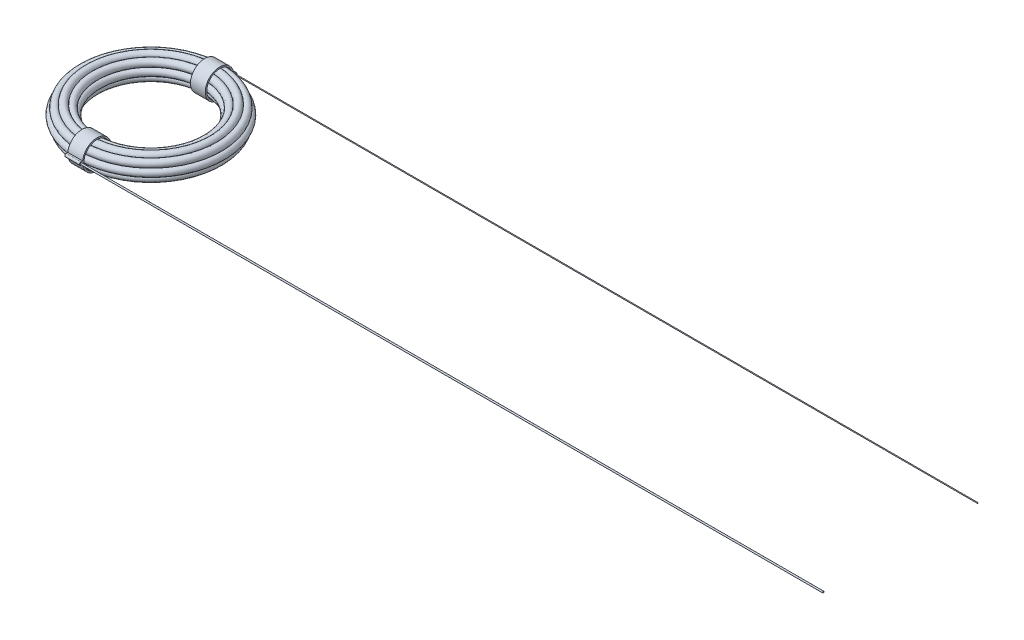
ISO-10303-21;
HEADER;
FILE_DESCRIPTION(('STEP AP214'),'2;1');
FILE_NAME('part.step','',(''),(''),'','','');
FILE_SCHEMA(('AUTOMOTIVE_DESIGN { 1 0 10303 214 1 1 1 1 }'));
ENDSEC;
DATA;
#1=APPLICATION_CONTEXT('core data for automotive mechanical design processes');
#2=APPLICATION_PROTOCOL_DEFINITION('international standard','automotive_design',2000,#1);
#3=PRODUCT_CONTEXT('',#1,'mechanical');
#4=PRODUCT('Part','Part','',(#3));
#5=PRODUCT_RELATED_PRODUCT_CATEGORY('part','',(#4));
#6=PRODUCT_DEFINITION_FORMATION('','',#4);
#7=PRODUCT_DEFINITION_CONTEXT('part definition',#1,'design');
#8=PRODUCT_DEFINITION('design','',#6,#7);
#9=PRODUCT_DEFINITION_SHAPE('','',#8);
#10=(LENGTH_UNIT() NAMED_UNIT(*) SI_UNIT(.MILLI.,.METRE.));
#11=(NAMED_UNIT(*) PLANE_ANGLE_UNIT() SI_UNIT($,.RADIAN.));
#12=(NAMED_UNIT(*) SI_UNIT($,.STERADIAN.) SOLID_ANGLE_UNIT());
#13=UNCERTAINTY_MEASURE_WITH_UNIT(LENGTH_MEASURE(1.E-05),#10,'distance_accuracy_value','');
#14=(GEOMETRIC_REPRESENTATION_CONTEXT(3) GLOBAL_UNCERTAINTY_ASSIGNED_CONTEXT((#13)) GLOBAL_UNIT_ASSIGNED_CONTEXT((#10,
#11,#12)) REPRESENTATION_CONTEXT('',''));
#15=CARTESIAN_POINT('',(0.,0.,0.));
#16=DIRECTION('',(0.,0.,1.));
#17=DIRECTION('',(1.,0.,0.));
#18=AXIS2_PLACEMENT_3D('',#15,#16,#17);
#19=CARTESIAN_POINT('',(0.,0.,0.));
#20=DIRECTION('',(0.,1.,0.));
#21=DIRECTION('',(0.,0.,1.));
#22=AXIS2_PLACEMENT_3D('',#19,#20,#21);
#23=TOROIDAL_SURFACE('',#22,142.5,7.49999999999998);
#24=CARTESIAN_POINT('',(0.,0.,142.5));
#25=DIRECTION('',(1.,0.,0.));
#26=DIRECTION('',(0.,0.,-1.));
#27=AXIS2_PLACEMENT_3D('',#24,#25,#26);
#28=CIRCLE('',#27,7.49999999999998);
#29=CARTESIAN_POINT('',(0.,0.,150.));
#30=VERTEX_POINT('',#29);
#31=EDGE_CURVE('E11',#30,#30,#28,.T.);
#32=CARTESIAN_POINT('',(0.,0.,0.));
#33=DIRECTION('',(0.,1.,0.));
#34=DIRECTION('',(0.,0.,1.));
#35=AXIS2_PLACEMENT_3D('',#32,#33,#34);
#36=CIRCLE('',#35,150.);
#37=EDGE_CURVE('',#30,#30,#36,.T.);
#38=ORIENTED_EDGE('',*,*,#31,.T.);
#39=ORIENTED_EDGE('',*,*,#31,.F.);
#40=ORIENTED_EDGE('',*,*,#37,.T.);
#41=ORIENTED_EDGE('',*,*,#37,.F.);
#42=EDGE_LOOP('',(#38,#40,#39,#41));
#43=FACE_BOUND('',#42,.T.);
#44=ADVANCED_FACE('F41',(#43),#23,.T.);
#45=CLOSED_SHELL('',(#44));
#46=MANIFOLD_SOLID_BREP('B2',#45);
#47=CARTESIAN_POINT('',(1515.,0.,-156.));
#48=DIRECTION('',(-1.,0.,0.));
#49=DIRECTION('',(0.,0.,1.));
#50=AXIS2_PLACEMENT_3D('',#47,#48,#49);
#51=CYLINDRICAL_SURFACE('',#50,0.750000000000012);
#52=CARTESIAN_POINT('',(1515.,0.,-156.));
#53=DIRECTION('',(1.,0.,0.));
#54=DIRECTION('',(0.,0.,-1.));
#55=AXIS2_PLACEMENT_3D('',#52,#53,#54);
#56=CIRCLE('',#55,0.750000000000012);
#57=CARTESIAN_POINT('',(1515.,0.,-156.75));
#58=VERTEX_POINT('',#57);
#59=EDGE_CURVE('E40',#58,#58,#56,.T.);
#60=ORIENTED_EDGE('',*,*,#59,.F.);
#61=EDGE_LOOP('',(#60));
#62=FACE_BOUND('',#61,.T.);
#63=CARTESIAN_POINT('',(15.,0.,-156.));
#64=DIRECTION('',(1.,0.,0.));
#65=DIRECTION('',(0.,0.,-1.));
#66=AXIS2_PLACEMENT_3D('',#63,#64,#65);
#67=CIRCLE('',#66,0.750000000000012);
#68=CARTESIAN_POINT('',(15.,0.,-156.75));
#69=VERTEX_POINT('',#68);
#70=EDGE_CURVE('E68',#69,#69,#67,.T.);
#71=ORIENTED_EDGE('',*,*,#70,.T.);
#72=EDGE_LOOP('',(#71));
#73=FACE_BOUND('',#72,.T.);
#74=ADVANCED_FACE('F65',(#62,#73),#51,.T.);
#75=CARTESIAN_POINT('',(1515.,0.,-156.));
#76=DIRECTION('',(1.,0.,0.));
#77=DIRECTION('',(0.,0.,-1.));
#78=AXIS2_PLACEMENT_3D('',#75,#76,#77);
#79=PLANE('',#78);
#80=ORIENTED_EDGE('',*,*,#59,.T.);
#81=EDGE_LOOP('',(#80));
#82=FACE_BOUND('',#81,.T.);
#83=ADVANCED_FACE('F80',(#82),#79,.T.);
#84=CARTESIAN_POINT('',(15.,0.,-156.));
#85=DIRECTION('',(1.,0.,0.));
#86=DIRECTION('',(0.,0.,-1.));
#87=AXIS2_PLACEMENT_3D('',#84,#85,#86);
#88=PLANE('',#87);
#89=ORIENTED_EDGE('',*,*,#70,.F.);
#90=EDGE_LOOP('',(#89));
#91=FACE_BOUND('',#90,.T.);
#92=ADVANCED_FACE('F78',(#91),#88,.F.);
#93=CLOSED_SHELL('',(#74,#83,#92));
#94=MANIFOLD_SOLID_BREP('B6',#93);
#95=CARTESIAN_POINT('',(1515.,0.,156.));
#96=DIRECTION('',(-1.,0.,0.));
#97=DIRECTION('',(0.,0.,1.));
#98=AXIS2_PLACEMENT_3D('',#95,#96,#97);
#99=CYLINDRICAL_SURFACE('',#98,1.5);
#100=CARTESIAN_POINT('',(1515.,0.,156.));
#101=DIRECTION('',(1.,0.,0.));
#102=DIRECTION('',(0.,0.,-1.));
#103=AXIS2_PLACEMENT_3D('',#100,#101,#102);
#104=CIRCLE('',#103,1.5);
#105=CARTESIAN_POINT('',(1515.,0.,154.5));
#106=VERTEX_POINT('',#105);
#107=EDGE_CURVE('E64',#106,#106,#104,.T.);
#108=ORIENTED_EDGE('',*,*,#107,.F.);
#109=EDGE_LOOP('',(#108));
#110=FACE_BOUND('',#109,.T.);
#111=CARTESIAN_POINT('',(15.,0.,156.));
#112=DIRECTION('',(1.,0.,0.));
#113=DIRECTION('',(0.,0.,-1.));
#114=AXIS2_PLACEMENT_3D('',#111,#112,#113);
#115=CIRCLE('',#114,1.5);
#116=CARTESIAN_POINT('',(15.,0.,154.5));
#117=VERTEX_POINT('',#116);
#118=EDGE_CURVE('E118',#117,#117,#115,.T.);
#119=ORIENTED_EDGE('',*,*,#118,.T.);
#120=EDGE_LOOP('',(#119));
#121=FACE_BOUND('',#120,.T.);
#122=ADVANCED_FACE('F115',(#110,#121),#99,.T.);
#123=CARTESIAN_POINT('',(1515.,0.,156.));
#124=DIRECTION('',(1.,0.,0.));
#125=DIRECTION('',(0.,0.,-1.));
#126=AXIS2_PLACEMENT_3D('',#123,#124,#125);
#127=PLANE('',#126);
#128=ORIENTED_EDGE('',*,*,#107,.T.);
#129=EDGE_LOOP('',(#128));
#130=FACE_BOUND('',#129,.T.);
#131=ADVANCED_FACE('F130',(#130),#127,.T.);
#132=CARTESIAN_POINT('',(15.,0.,156.));
#133=DIRECTION('',(1.,0.,0.));
#134=DIRECTION('',(0.,0.,-1.));
#135=AXIS2_PLACEMENT_3D('',#132,#133,#134);
#136=PLANE('',#135);
#137=ORIENTED_EDGE('',*,*,#118,.F.);
#138=EDGE_LOOP('',(#137));
#139=FACE_BOUND('',#138,.T.);
#140=ADVANCED_FACE('F128',(#139),#136,.F.);
#141=CLOSED_SHELL('',(#122,#131,#140));
#142=MANIFOLD_SOLID_BREP('B35',#141);
#143=CARTESIAN_POINT('',(-15.,0.,-156.));
#144=DIRECTION('',(-1.,0.,0.));
#145=DIRECTION('',(0.,0.,1.));
#146=AXIS2_PLACEMENT_3D('',#143,#144,#145);
#147=PLANE('',#146);
#148=CARTESIAN_POINT('',(-15.,0.,-156.));
#149=DIRECTION('',(-1.,0.,0.));
#150=DIRECTION('',(0.,0.,1.));
#151=AXIS2_PLACEMENT_3D('',#148,#149,#150);
#152=CIRCLE('',#151,3.);
#153=CARTESIAN_POINT('',(-15.,3.,-156.));
#154=VERTEX_POINT('',#153);
#155=CARTESIAN_POINT('',(-15.,-3.,-156.));
#156=VERTEX_POINT('',#155);
#157=EDGE_CURVE('E217',#154,#156,#152,.T.);
#158=ORIENTED_EDGE('',*,*,#157,.T.);
#159=DIRECTION('',(0.,0.,1.));
#160=VECTOR('',#159,1.);
#161=CARTESIAN_POINT('',(-15.,-3.,-156.));
#162=LINE('',#161,#160);
#163=CARTESIAN_POINT('',(-15.,-3.,-152.844410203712));
#164=VERTEX_POINT('',#163);
#165=EDGE_CURVE('E211',#156,#164,#162,.T.);
#166=ORIENTED_EDGE('',*,*,#165,.T.);
#167=CARTESIAN_POINT('',(-15.,0.,-124.));
#168=DIRECTION('',(-1.,0.,0.));
#169=DIRECTION('',(0.,0.,1.));
#170=AXIS2_PLACEMENT_3D('',#167,#168,#169);
#171=CIRCLE('',#170,29.);
#172=CARTESIAN_POINT('',(-15.,2.99999999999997,-152.844410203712));
#173=VERTEX_POINT('',#172);
#174=EDGE_CURVE('E214',#164,#173,#171,.T.);
#175=ORIENTED_EDGE('',*,*,#174,.T.);
#176=DIRECTION('',(0.,0.,-1.));
#177=VECTOR('',#176,1.);
#178=CARTESIAN_POINT('',(-15.,3.,-156.));
#179=LINE('',#178,#177);
#180=EDGE_CURVE('E184',#173,#154,#179,.T.);
#181=ORIENTED_EDGE('',*,*,#180,.T.);
#182=EDGE_LOOP('',(#158,#166,#175,#181));
#183=FACE_BOUND('',#182,.T.);
#184=CARTESIAN_POINT('',(-15.,0.,-124.));
#185=DIRECTION('',(-1.,0.,0.));
#186=DIRECTION('',(0.,0.,1.));
#187=AXIS2_PLACEMENT_3D('',#184,#185,#186);
#188=CIRCLE('',#187,26.);
#189=CARTESIAN_POINT('',(-15.,0.,-98.));
#190=VERTEX_POINT('',#189);
#191=EDGE_CURVE('E235',#190,#190,#188,.T.);
#192=ORIENTED_EDGE('',*,*,#191,.F.);
#193=EDGE_LOOP('',(#192));
#194=FACE_BOUND('',#193,.T.);
#195=ADVANCED_FACE('F165',(#183,#194),#147,.T.);
#196=CARTESIAN_POINT('',(15.,0.,-156.));
#197=DIRECTION('',(-1.,0.,0.));
#198=DIRECTION('',(0.,0.,1.));
#199=AXIS2_PLACEMENT_3D('',#196,#197,#198);
#200=PLANE('',#199);
#201=CARTESIAN_POINT('',(15.,0.,-156.));
#202=DIRECTION('',(-1.,0.,0.));
#203=DIRECTION('',(0.,0.,1.));
#204=AXIS2_PLACEMENT_3D('',#201,#202,#203);
#205=CIRCLE('',#204,3.);
#206=CARTESIAN_POINT('',(15.,3.,-156.));
#207=VERTEX_POINT('',#206);
#208=CARTESIAN_POINT('',(15.,-3.,-156.));
#209=VERTEX_POINT('',#208);
#210=EDGE_CURVE('E232',#207,#209,#205,.T.);
#211=ORIENTED_EDGE('',*,*,#210,.F.);
#212=DIRECTION('',(0.,0.,-1.));
#213=VECTOR('',#212,1.);
#214=CARTESIAN_POINT('',(15.,3.,-156.));
#215=LINE('',#214,#213);
#216=CARTESIAN_POINT('',(15.,2.99999999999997,-152.844410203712));
#217=VERTEX_POINT('',#216);
#218=EDGE_CURVE('E204',#217,#207,#215,.T.);
#219=ORIENTED_EDGE('',*,*,#218,.F.);
#220=CARTESIAN_POINT('',(15.,0.,-124.));
#221=DIRECTION('',(-1.,0.,0.));
#222=DIRECTION('',(0.,0.,1.));
#223=AXIS2_PLACEMENT_3D('',#220,#221,#222);
#224=CIRCLE('',#223,29.);
#225=CARTESIAN_POINT('',(15.,-3.,-152.844410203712));
#226=VERTEX_POINT('',#225);
#227=EDGE_CURVE('E237',#226,#217,#224,.T.);
#228=ORIENTED_EDGE('',*,*,#227,.F.);
#229=DIRECTION('',(0.,0.,1.));
#230=VECTOR('',#229,1.);
#231=CARTESIAN_POINT('',(15.,-3.,-156.));
#232=LINE('',#231,#230);
#233=EDGE_CURVE('E222',#209,#226,#232,.T.);
#234=ORIENTED_EDGE('',*,*,#233,.F.);
#235=EDGE_LOOP('',(#211,#219,#228,#234));
#236=FACE_BOUND('',#235,.T.);
#237=CARTESIAN_POINT('',(15.,0.,-124.));
#238=DIRECTION('',(-1.,0.,0.));
#239=DIRECTION('',(0.,0.,1.));
#240=AXIS2_PLACEMENT_3D('',#237,#238,#239);
#241=CIRCLE('',#240,26.);
#242=CARTESIAN_POINT('',(15.,0.,-98.));
#243=VERTEX_POINT('',#242);
#244=EDGE_CURVE('E248',#243,#243,#241,.T.);
#245=ORIENTED_EDGE('',*,*,#244,.T.);
#246=EDGE_LOOP('',(#245));
#247=FACE_BOUND('',#246,.T.);
#248=ADVANCED_FACE('F244',(#236,#247),#200,.F.);
#249=CARTESIAN_POINT('',(-15.,0.,-156.));
#250=DIRECTION('',(1.,0.,0.));
#251=DIRECTION('',(0.,0.,-1.));
#252=AXIS2_PLACEMENT_3D('',#249,#250,#251);
#253=CYLINDRICAL_SURFACE('',#252,3.);
#254=ORIENTED_EDGE('',*,*,#210,.T.);
#255=DIRECTION('',(1.,0.,0.));
#256=VECTOR('',#255,1.);
#257=CARTESIAN_POINT('',(-15.,-3.,-156.));
#258=LINE('',#257,#256);
#259=EDGE_CURVE('E113',#156,#209,#258,.T.);
#260=ORIENTED_EDGE('',*,*,#259,.F.);
#261=ORIENTED_EDGE('',*,*,#157,.F.);
#262=DIRECTION('',(1.,0.,0.));
#263=VECTOR('',#262,1.);
#264=CARTESIAN_POINT('',(-15.,3.,-156.));
#265=LINE('',#264,#263);
#266=EDGE_CURVE('E228',#154,#207,#265,.T.);
#267=ORIENTED_EDGE('',*,*,#266,.T.);
#268=EDGE_LOOP('',(#254,#260,#261,#267));
#269=FACE_BOUND('',#268,.T.);
#270=ADVANCED_FACE('F167',(#269),#253,.T.);
#271=CARTESIAN_POINT('',(-15.,-3.,-156.));
#272=DIRECTION('',(0.,1.,0.));
#273=DIRECTION('',(0.,0.,-1.));
#274=AXIS2_PLACEMENT_3D('',#271,#272,#273);
#275=PLANE('',#274);
#276=ORIENTED_EDGE('',*,*,#233,.T.);
#277=DIRECTION('',(1.,0.,0.));
#278=VECTOR('',#277,1.);
#279=CARTESIAN_POINT('',(-15.,-3.,-152.844410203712));
#280=LINE('',#279,#278);
#281=EDGE_CURVE('E173',#164,#226,#280,.T.);
#282=ORIENTED_EDGE('',*,*,#281,.F.);
#283=ORIENTED_EDGE('',*,*,#165,.F.);
#284=ORIENTED_EDGE('',*,*,#259,.T.);
#285=EDGE_LOOP('',(#276,#282,#283,#284));
#286=FACE_BOUND('',#285,.T.);
#287=ADVANCED_FACE('F221',(#286),#275,.F.);
#288=CARTESIAN_POINT('',(-15.,0.,-124.));
#289=DIRECTION('',(1.,0.,0.));
#290=DIRECTION('',(0.,0.,-1.));
#291=AXIS2_PLACEMENT_3D('',#288,#289,#290);
#292=CYLINDRICAL_SURFACE('',#291,29.);
#293=ORIENTED_EDGE('',*,*,#227,.T.);
#294=DIRECTION('',(1.,0.,0.));
#295=VECTOR('',#294,1.);
#296=CARTESIAN_POINT('',(-15.,2.99999999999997,-152.844410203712));
#297=LINE('',#296,#295);
#298=EDGE_CURVE('E225',#173,#217,#297,.T.);
#299=ORIENTED_EDGE('',*,*,#298,.F.);
#300=ORIENTED_EDGE('',*,*,#174,.F.);
#301=ORIENTED_EDGE('',*,*,#281,.T.);
#302=EDGE_LOOP('',(#293,#299,#300,#301));
#303=FACE_BOUND('',#302,.T.);
#304=ADVANCED_FACE('F226',(#303),#292,.T.);
#305=CARTESIAN_POINT('',(-15.,3.,-156.));
#306=DIRECTION('',(0.,-1.,0.));
#307=DIRECTION('',(0.,0.,1.));
#308=AXIS2_PLACEMENT_3D('',#305,#306,#307);
#309=PLANE('',#308);
#310=ORIENTED_EDGE('',*,*,#218,.T.);
#311=ORIENTED_EDGE('',*,*,#266,.F.);
#312=ORIENTED_EDGE('',*,*,#180,.F.);
#313=ORIENTED_EDGE('',*,*,#298,.T.);
#314=EDGE_LOOP('',(#310,#311,#312,#313));
#315=FACE_BOUND('',#314,.T.);
#316=ADVANCED_FACE('F241',(#315),#309,.F.);
#317=CARTESIAN_POINT('',(-15.,0.,-124.));
#318=DIRECTION('',(1.,0.,0.));
#319=DIRECTION('',(0.,0.,-1.));
#320=AXIS2_PLACEMENT_3D('',#317,#318,#319);
#321=CYLINDRICAL_SURFACE('',#320,26.);
#322=CARTESIAN_POINT('',(0.,0.,-150.));
#323=VERTEX_POINT('',#322);
#324=VERTEX_LOOP('',#323);
#325=FACE_BOUND('',#324,.T.);
#326=ORIENTED_EDGE('',*,*,#191,.T.);
#327=EDGE_LOOP('',(#326));
#328=FACE_BOUND('',#327,.T.);
#329=ORIENTED_EDGE('',*,*,#244,.F.);
#330=EDGE_LOOP('',(#329));
#331=FACE_BOUND('',#330,.T.);
#332=ADVANCED_FACE('F254',(#325,#328,#331),#321,.F.);
#333=CLOSED_SHELL('',(#195,#248,#270,#287,#304,#316,#332));
#334=MANIFOLD_SOLID_BREP('B59',#333);
#335=CARTESIAN_POINT('',(15.,0.,156.));
#336=DIRECTION('',(1.,0.,0.));
#337=DIRECTION('',(0.,0.,-1.));
#338=AXIS2_PLACEMENT_3D('',#335,#336,#337);
#339=PLANE('',#338);
#340=CARTESIAN_POINT('',(15.,0.,156.));
#341=DIRECTION('',(1.,0.,0.));
#342=DIRECTION('',(0.,0.,-1.));
#343=AXIS2_PLACEMENT_3D('',#340,#341,#342);
#344=CIRCLE('',#343,3.);
#345=CARTESIAN_POINT('',(15.,3.,156.));
#346=VERTEX_POINT('',#345);
#347=CARTESIAN_POINT('',(15.,-3.,156.));
#348=VERTEX_POINT('',#347);
#349=EDGE_CURVE('E374',#346,#348,#344,.T.);
#350=ORIENTED_EDGE('',*,*,#349,.T.);
#351=DIRECTION('',(0.,0.,-1.));
#352=VECTOR('',#351,1.);
#353=CARTESIAN_POINT('',(15.,-3.,156.));
#354=LINE('',#353,#352);
#355=CARTESIAN_POINT('',(15.,-3.,152.844410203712));
#356=VERTEX_POINT('',#355);
#357=EDGE_CURVE('E368',#348,#356,#354,.T.);
#358=ORIENTED_EDGE('',*,*,#357,.T.);
#359=CARTESIAN_POINT('',(15.,0.,124.));
#360=DIRECTION('',(1.,0.,0.));
#361=DIRECTION('',(0.,0.,-1.));
#362=AXIS2_PLACEMENT_3D('',#359,#360,#361);
#363=CIRCLE('',#362,29.);
#364=CARTESIAN_POINT('',(15.,2.99999999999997,152.844410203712));
#365=VERTEX_POINT('',#364);
#366=EDGE_CURVE('E371',#356,#365,#363,.T.);
#367=ORIENTED_EDGE('',*,*,#366,.T.);
#368=DIRECTION('',(0.,0.,1.));
#369=VECTOR('',#368,1.);
#370=CARTESIAN_POINT('',(15.,3.,156.));
#371=LINE('',#370,#369);
#372=EDGE_CURVE('E341',#365,#346,#371,.T.);
#373=ORIENTED_EDGE('',*,*,#372,.T.);
#374=EDGE_LOOP('',(#350,#358,#367,#373));
#375=FACE_BOUND('',#374,.T.);
#376=CARTESIAN_POINT('',(15.,0.,124.));
#377=DIRECTION('',(1.,0.,0.));
#378=DIRECTION('',(0.,0.,-1.));
#379=AXIS2_PLACEMENT_3D('',#376,#377,#378);
#380=CIRCLE('',#379,26.);
#381=CARTESIAN_POINT('',(15.,0.,98.));
#382=VERTEX_POINT('',#381);
#383=EDGE_CURVE('E392',#382,#382,#380,.T.);
#384=ORIENTED_EDGE('',*,*,#383,.F.);
#385=EDGE_LOOP('',(#384));
#386=FACE_BOUND('',#385,.T.);
#387=ADVANCED_FACE('F322',(#375,#386),#339,.T.);
#388=CARTESIAN_POINT('',(-15.,0.,156.));
#389=DIRECTION('',(1.,0.,0.));
#390=DIRECTION('',(0.,0.,-1.));
#391=AXIS2_PLACEMENT_3D('',#388,#389,#390);
#392=PLANE('',#391);
#393=CARTESIAN_POINT('',(-15.,0.,156.));
#394=DIRECTION('',(1.,0.,0.));
#395=DIRECTION('',(0.,0.,-1.));
#396=AXIS2_PLACEMENT_3D('',#393,#394,#395);
#397=CIRCLE('',#396,3.);
#398=CARTESIAN_POINT('',(-15.,3.,156.));
#399=VERTEX_POINT('',#398);
#400=CARTESIAN_POINT('',(-15.,-3.,156.));
#401=VERTEX_POINT('',#400);
#402=EDGE_CURVE('E389',#399,#401,#397,.T.);
#403=ORIENTED_EDGE('',*,*,#402,.F.);
#404=DIRECTION('',(0.,0.,1.));
#405=VECTOR('',#404,1.);
#406=CARTESIAN_POINT('',(-15.,3.,156.));
#407=LINE('',#406,#405);
#408=CARTESIAN_POINT('',(-15.,2.99999999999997,152.844410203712));
#409=VERTEX_POINT('',#408);
#410=EDGE_CURVE('E361',#409,#399,#407,.T.);
#411=ORIENTED_EDGE('',*,*,#410,.F.);
#412=CARTESIAN_POINT('',(-15.,0.,124.));
#413=DIRECTION('',(1.,0.,0.));
#414=DIRECTION('',(0.,0.,-1.));
#415=AXIS2_PLACEMENT_3D('',#412,#413,#414);
#416=CIRCLE('',#415,29.);
#417=CARTESIAN_POINT('',(-15.,-3.,152.844410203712));
#418=VERTEX_POINT('',#417);
#419=EDGE_CURVE('E394',#418,#409,#416,.T.);
#420=ORIENTED_EDGE('',*,*,#419,.F.);
#421=DIRECTION('',(0.,0.,-1.));
#422=VECTOR('',#421,1.);
#423=CARTESIAN_POINT('',(-15.,-3.,156.));
#424=LINE('',#423,#422);
#425=EDGE_CURVE('E379',#401,#418,#424,.T.);
#426=ORIENTED_EDGE('',*,*,#425,.F.);
#427=EDGE_LOOP('',(#403,#411,#420,#426));
#428=FACE_BOUND('',#427,.T.);
#429=CARTESIAN_POINT('',(-15.,0.,124.));
#430=DIRECTION('',(1.,0.,0.));
#431=DIRECTION('',(0.,0.,-1.));
#432=AXIS2_PLACEMENT_3D('',#429,#430,#431);
#433=CIRCLE('',#432,26.);
#434=CARTESIAN_POINT('',(-15.,0.,98.));
#435=VERTEX_POINT('',#434);
#436=EDGE_CURVE('E405',#435,#435,#433,.T.);
#437=ORIENTED_EDGE('',*,*,#436,.T.);
#438=EDGE_LOOP('',(#437));
#439=FACE_BOUND('',#438,.T.);
#440=ADVANCED_FACE('F401',(#428,#439),#392,.F.);
#441=CARTESIAN_POINT('',(15.,0.,156.));
#442=DIRECTION('',(-1.,0.,0.));
#443=DIRECTION('',(0.,0.,1.));
#444=AXIS2_PLACEMENT_3D('',#441,#442,#443);
#445=CYLINDRICAL_SURFACE('',#444,3.);
#446=ORIENTED_EDGE('',*,*,#402,.T.);
#447=DIRECTION('',(-1.,0.,0.));
#448=VECTOR('',#447,1.);
#449=CARTESIAN_POINT('',(15.,-3.,156.));
#450=LINE('',#449,#448);
#451=EDGE_CURVE('E163',#348,#401,#450,.T.);
#452=ORIENTED_EDGE('',*,*,#451,.F.);
#453=ORIENTED_EDGE('',*,*,#349,.F.);
#454=DIRECTION('',(-1.,0.,0.));
#455=VECTOR('',#454,1.);
#456=CARTESIAN_POINT('',(15.,3.,156.));
#457=LINE('',#456,#455);
#458=EDGE_CURVE('E385',#346,#399,#457,.T.);
#459=ORIENTED_EDGE('',*,*,#458,.T.);
#460=EDGE_LOOP('',(#446,#452,#453,#459));
#461=FACE_BOUND('',#460,.T.);
#462=ADVANCED_FACE('F324',(#461),#445,.T.);
#463=CARTESIAN_POINT('',(15.,-3.,156.));
#464=DIRECTION('',(0.,1.,0.));
#465=DIRECTION('',(0.,0.,1.));
#466=AXIS2_PLACEMENT_3D('',#463,#464,#465);
#467=PLANE('',#466);
#468=ORIENTED_EDGE('',*,*,#425,.T.);
#469=DIRECTION('',(-1.,0.,0.));
#470=VECTOR('',#469,1.);
#471=CARTESIAN_POINT('',(15.,-3.,152.844410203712));
#472=LINE('',#471,#470);
#473=EDGE_CURVE('E330',#356,#418,#472,.T.);
#474=ORIENTED_EDGE('',*,*,#473,.F.);
#475=ORIENTED_EDGE('',*,*,#357,.F.);
#476=ORIENTED_EDGE('',*,*,#451,.T.);
#477=EDGE_LOOP('',(#468,#474,#475,#476));
#478=FACE_BOUND('',#477,.T.);
#479=ADVANCED_FACE('F378',(#478),#467,.F.);
#480=CARTESIAN_POINT('',(15.,0.,124.));
#481=DIRECTION('',(-1.,0.,0.));
#482=DIRECTION('',(0.,0.,1.));
#483=AXIS2_PLACEMENT_3D('',#480,#481,#482);
#484=CYLINDRICAL_SURFACE('',#483,29.);
#485=ORIENTED_EDGE('',*,*,#419,.T.);
#486=DIRECTION('',(-1.,0.,0.));
#487=VECTOR('',#486,1.);
#488=CARTESIAN_POINT('',(15.,2.99999999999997,152.844410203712));
#489=LINE('',#488,#487);
#490=EDGE_CURVE('E382',#365,#409,#489,.T.);
#491=ORIENTED_EDGE('',*,*,#490,.F.);
#492=ORIENTED_EDGE('',*,*,#366,.F.);
#493=ORIENTED_EDGE('',*,*,#473,.T.);
#494=EDGE_LOOP('',(#485,#491,#492,#493));
#495=FACE_BOUND('',#494,.T.);
#496=ADVANCED_FACE('F383',(#495),#484,.T.);
#497=CARTESIAN_POINT('',(15.,3.,156.));
#498=DIRECTION('',(0.,-1.,0.));
#499=DIRECTION('',(0.,0.,-1.));
#500=AXIS2_PLACEMENT_3D('',#497,#498,#499);
#501=PLANE('',#500);
#502=ORIENTED_EDGE('',*,*,#410,.T.);
#503=ORIENTED_EDGE('',*,*,#458,.F.);
#504=ORIENTED_EDGE('',*,*,#372,.F.);
#505=ORIENTED_EDGE('',*,*,#490,.T.);
#506=EDGE_LOOP('',(#502,#503,#504,#505));
#507=FACE_BOUND('',#506,.T.);
#508=ADVANCED_FACE('F398',(#507),#501,.F.);
#509=CARTESIAN_POINT('',(15.,0.,124.));
#510=DIRECTION('',(-1.,0.,0.));
#511=DIRECTION('',(0.,0.,1.));
#512=AXIS2_PLACEMENT_3D('',#509,#510,#511);
#513=CYLINDRICAL_SURFACE('',#512,26.);
#514=CARTESIAN_POINT('',(0.,0.,150.));
#515=VERTEX_POINT('',#514);
#516=VERTEX_LOOP('',#515);
#517=FACE_BOUND('',#516,.T.);
#518=ORIENTED_EDGE('',*,*,#383,.T.);
#519=EDGE_LOOP('',(#518));
#520=FACE_BOUND('',#519,.T.);
#521=ORIENTED_EDGE('',*,*,#436,.F.);
#522=EDGE_LOOP('',(#521));
#523=FACE_BOUND('',#522,.T.);
#524=ADVANCED_FACE('F411',(#517,#520,#523),#513,.F.);
#525=CLOSED_SHELL('',(#387,#440,#462,#479,#496,#508,#524));
#526=MANIFOLD_SOLID_BREP('B107',#525);
#527=CARTESIAN_POINT('',(0.,17.5000000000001,0.));
#528=DIRECTION('',(0.,1.,0.));
#529=DIRECTION('',(0.,0.,1.));
#530=AXIS2_PLACEMENT_3D('',#527,#528,#529);
#531=TOROIDAL_SURFACE('',#530,125.,7.49999999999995);
#532=CARTESIAN_POINT('',(0.,18.0566599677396,0.));
#533=DIRECTION('',(0.,1.,0.));
#534=DIRECTION('',(0.,0.,1.));
#535=AXIS2_PLACEMENT_3D('',#532,#533,#534);
#536=CIRCLE('',#535,132.479313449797);
#537=CARTESIAN_POINT('',(0.,18.0566599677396,132.479313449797));
#538=VERTEX_POINT('',#537);
#539=EDGE_CURVE('E320',#538,#538,#536,.T.);
#540=ORIENTED_EDGE('',*,*,#539,.T.);
#541=EDGE_LOOP('',(#540));
#542=FACE_BOUND('',#541,.T.);
#543=CARTESIAN_POINT('',(0.,18.0566599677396,0.));
#544=DIRECTION('',(0.,1.,0.));
#545=DIRECTION('',(0.,0.,1.));
#546=AXIS2_PLACEMENT_3D('',#543,#544,#545);
#547=CIRCLE('',#546,117.520686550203);
#548=CARTESIAN_POINT('',(0.,18.0566599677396,117.520686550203));
#549=VERTEX_POINT('',#548);
#550=EDGE_CURVE('E489',#549,#549,#547,.T.);
#551=ORIENTED_EDGE('',*,*,#550,.F.);
#552=EDGE_LOOP('',(#551));
#553=FACE_BOUND('',#552,.T.);
#554=ADVANCED_FACE('F470',(#542,#553),#531,.T.);
#555=CARTESIAN_POINT('',(0.,12.3743686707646,0.));
#556=DIRECTION('',(0.,1.,0.));
#557=DIRECTION('',(0.,0.,1.));
#558=AXIS2_PLACEMENT_3D('',#555,#556,#557);
#559=TOROIDAL_SURFACE('',#558,137.374368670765,7.49999999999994);
#560=CARTESIAN_POINT('',(0.,7.4793134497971,0.));
#561=DIRECTION('',(0.,1.,0.));
#562=DIRECTION('',(0.,0.,1.));
#563=AXIS2_PLACEMENT_3D('',#560,#561,#562);
#564=CIRCLE('',#563,143.05665996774);
#565=CARTESIAN_POINT('',(0.,7.4793134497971,143.05665996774));
#566=VERTEX_POINT('',#565);
#567=EDGE_CURVE('E477',#566,#566,#564,.T.);
#568=ORIENTED_EDGE('',*,*,#567,.T.);
#569=EDGE_LOOP('',(#568));
#570=FACE_BOUND('',#569,.T.);
#571=ORIENTED_EDGE('',*,*,#539,.F.);
#572=EDGE_LOOP('',(#571));
#573=FACE_BOUND('',#572,.T.);
#574=ADVANCED_FACE('F507',(#570,#573),#559,.T.);
#575=CARTESIAN_POINT('',(0.,-12.3743686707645,0.));
#576=DIRECTION('',(0.,1.,0.));
#577=DIRECTION('',(0.,0.,1.));
#578=AXIS2_PLACEMENT_3D('',#575,#576,#577);
#579=TOROIDAL_SURFACE('',#578,137.374368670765,7.49999999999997);
#580=CARTESIAN_POINT('',(0.,-18.0566599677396,0.));
#581=DIRECTION('',(0.,1.,0.));
#582=DIRECTION('',(0.,0.,1.));
#583=AXIS2_PLACEMENT_3D('',#580,#581,#582);
#584=CIRCLE('',#583,132.479313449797);
#585=CARTESIAN_POINT('',(0.,-18.0566599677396,132.479313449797));
#586=VERTEX_POINT('',#585);
#587=EDGE_CURVE('E503',#586,#586,#584,.T.);
#588=ORIENTED_EDGE('',*,*,#587,.T.);
#589=EDGE_LOOP('',(#588));
#590=FACE_BOUND('',#589,.T.);
#591=CARTESIAN_POINT('',(0.,-7.4793134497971,0.));
#592=DIRECTION('',(0.,1.,0.));
#593=DIRECTION('',(0.,0.,1.));
#594=AXIS2_PLACEMENT_3D('',#591,#592,#593);
#595=CIRCLE('',#594,143.05665996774);
#596=CARTESIAN_POINT('',(0.,-7.4793134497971,143.05665996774));
#597=VERTEX_POINT('',#596);
#598=EDGE_CURVE('E487',#597,#597,#595,.T.);
#599=ORIENTED_EDGE('',*,*,#598,.F.);
#600=EDGE_LOOP('',(#599));
#601=FACE_BOUND('',#600,.T.);
#602=ADVANCED_FACE('F510',(#590,#601),#579,.T.);
#603=CARTESIAN_POINT('',(0.,-17.5000000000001,0.));
#604=DIRECTION('',(0.,1.,0.));
#605=DIRECTION('',(0.,0.,1.));
#606=AXIS2_PLACEMENT_3D('',#603,#604,#605);
#607=TOROIDAL_SURFACE('',#606,125.,7.49999999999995);
#608=CARTESIAN_POINT('',(0.,-18.0566599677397,0.));
#609=DIRECTION('',(0.,1.,0.));
#610=DIRECTION('',(0.,0.,1.));
#611=AXIS2_PLACEMENT_3D('',#608,#609,#610);
#612=CIRCLE('',#611,117.520686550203);
#613=CARTESIAN_POINT('',(0.,-18.0566599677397,117.520686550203));
#614=VERTEX_POINT('',#613);
#615=EDGE_CURVE('E500',#614,#614,#612,.T.);
#616=ORIENTED_EDGE('',*,*,#615,.T.);
#617=EDGE_LOOP('',(#616));
#618=FACE_BOUND('',#617,.T.);
#619=ORIENTED_EDGE('',*,*,#587,.F.);
#620=EDGE_LOOP('',(#619));
#621=FACE_BOUND('',#620,.T.);
#622=ADVANCED_FACE('F532',(#618,#621),#607,.T.);
#623=CARTESIAN_POINT('',(0.,-12.3743686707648,0.));
#624=DIRECTION('',(0.,1.,0.));
#625=DIRECTION('',(0.,0.,1.));
#626=AXIS2_PLACEMENT_3D('',#623,#624,#625);
#627=TOROIDAL_SURFACE('',#626,112.625631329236,7.49999999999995);
#628=CARTESIAN_POINT('',(0.,-7.47931344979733,0.));
#629=DIRECTION('',(0.,1.,0.));
#630=DIRECTION('',(0.,0.,1.));
#631=AXIS2_PLACEMENT_3D('',#628,#629,#630);
#632=CIRCLE('',#631,106.94334003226);
#633=CARTESIAN_POINT('',(0.,-7.47931344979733,106.94334003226));
#634=VERTEX_POINT('',#633);
#635=EDGE_CURVE('E497',#634,#634,#632,.T.);
#636=ORIENTED_EDGE('',*,*,#635,.T.);
#637=EDGE_LOOP('',(#636));
#638=FACE_BOUND('',#637,.T.);
#639=ORIENTED_EDGE('',*,*,#615,.F.);
#640=EDGE_LOOP('',(#639));
#641=FACE_BOUND('',#640,.T.);
#642=ADVANCED_FACE('F526',(#638,#641),#627,.T.);
#643=CARTESIAN_POINT('',(0.,-1.47140358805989E-13,0.));
#644=DIRECTION('',(0.,1.,0.));
#645=DIRECTION('',(0.,0.,1.));
#646=AXIS2_PLACEMENT_3D('',#643,#644,#645);
#647=TOROIDAL_SURFACE('',#646,107.499999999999,7.49999999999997);
#648=CARTESIAN_POINT('',(0.,7.47931344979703,0.));
#649=DIRECTION('',(0.,1.,0.));
#650=DIRECTION('',(0.,0.,1.));
#651=AXIS2_PLACEMENT_3D('',#648,#649,#650);
#652=CIRCLE('',#651,106.94334003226);
#653=CARTESIAN_POINT('',(0.,7.47931344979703,106.94334003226));
#654=VERTEX_POINT('',#653);
#655=EDGE_CURVE('E492',#654,#654,#652,.T.);
#656=ORIENTED_EDGE('',*,*,#655,.T.);
#657=EDGE_LOOP('',(#656));
#658=FACE_BOUND('',#657,.T.);
#659=ORIENTED_EDGE('',*,*,#635,.F.);
#660=EDGE_LOOP('',(#659));
#661=FACE_BOUND('',#660,.T.);
#662=ADVANCED_FACE('F520',(#658,#661),#647,.T.);
#663=CARTESIAN_POINT('',(0.,12.3743686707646,0.));
#664=DIRECTION('',(0.,1.,0.));
#665=DIRECTION('',(0.,0.,1.));
#666=AXIS2_PLACEMENT_3D('',#663,#664,#665);
#667=TOROIDAL_SURFACE('',#666,112.625631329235,7.49999999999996);
#668=ORIENTED_EDGE('',*,*,#550,.T.);
#669=EDGE_LOOP('',(#668));
#670=FACE_BOUND('',#669,.T.);
#671=ORIENTED_EDGE('',*,*,#655,.F.);
#672=EDGE_LOOP('',(#671));
#673=FACE_BOUND('',#672,.T.);
#674=ADVANCED_FACE('F517',(#670,#673),#667,.T.);
#675=CARTESIAN_POINT('',(0.,0.,0.));
#676=DIRECTION('',(0.,1.,0.));
#677=DIRECTION('',(0.,0.,1.));
#678=AXIS2_PLACEMENT_3D('',#675,#676,#677);
#679=TOROIDAL_SURFACE('',#678,142.5,7.49999999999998);
#680=ORIENTED_EDGE('',*,*,#567,.F.);
#681=CARTESIAN_POINT('',(0.,0.,142.5));
#682=DIRECTION('',(1.,0.,0.));
#683=DIRECTION('',(0.,0.,-1.));
#684=AXIS2_PLACEMENT_3D('',#681,#682,#683);
#685=CIRCLE('',#684,7.49999999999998);
#686=EDGE_CURVE('E484',#597,#566,#685,.T.);
#687=ORIENTED_EDGE('',*,*,#686,.F.);
#688=ORIENTED_EDGE('',*,*,#598,.T.);
#689=ORIENTED_EDGE('',*,*,#686,.T.);
#690=EDGE_LOOP('',(#680,#687,#688,#689));
#691=FACE_BOUND('',#690,.T.);
#692=ADVANCED_FACE('F485',(#691),#679,.F.);
#693=CLOSED_SHELL('',(#554,#574,#602,#622,#642,#662,#674,#692));
#694=MANIFOLD_SOLID_BREP('B157',#693);
#695=ADVANCED_BREP_SHAPE_REPRESENTATION('',(#18,#46,#94,#142,#334,#526,#694),#14);
#696=SHAPE_DEFINITION_REPRESENTATION(#9,#695);
ENDSEC;
END-ISO-10303-21;
